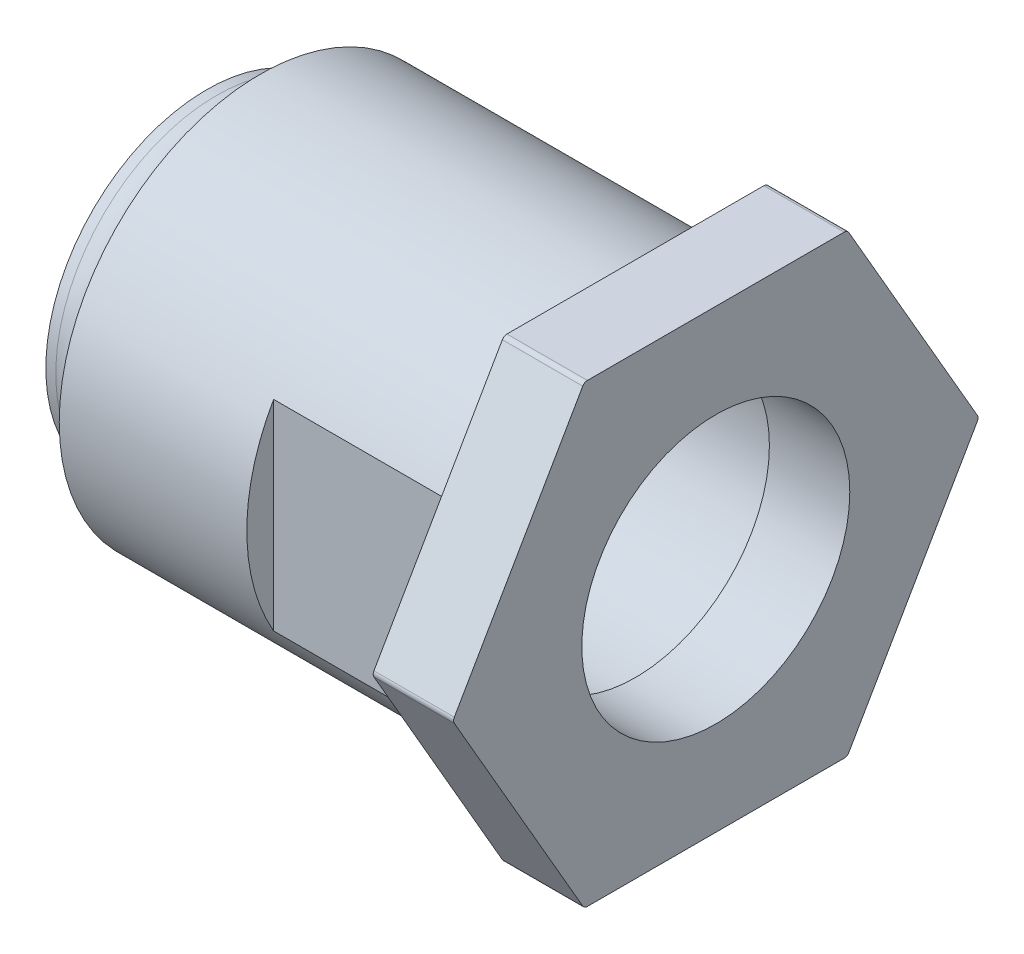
ISO-10303-21;
HEADER;
FILE_DESCRIPTION(('STEP AP214'),'2;1');
FILE_NAME('part.step','',(''),(''),'','','');
FILE_SCHEMA(('AUTOMOTIVE_DESIGN { 1 0 10303 214 1 1 1 1 }'));
ENDSEC;
DATA;
#1=APPLICATION_CONTEXT('core data for automotive mechanical design processes');
#2=APPLICATION_PROTOCOL_DEFINITION('international standard','automotive_design',2000,#1);
#3=PRODUCT_CONTEXT('',#1,'mechanical');
#4=PRODUCT('Part','Part','',(#3));
#5=PRODUCT_RELATED_PRODUCT_CATEGORY('part','',(#4));
#6=PRODUCT_DEFINITION_FORMATION('','',#4);
#7=PRODUCT_DEFINITION_CONTEXT('part definition',#1,'design');
#8=PRODUCT_DEFINITION('design','',#6,#7);
#9=PRODUCT_DEFINITION_SHAPE('','',#8);
#10=(LENGTH_UNIT() NAMED_UNIT(*) SI_UNIT(.MILLI.,.METRE.));
#11=(NAMED_UNIT(*) PLANE_ANGLE_UNIT() SI_UNIT($,.RADIAN.));
#12=(NAMED_UNIT(*) SI_UNIT($,.STERADIAN.) SOLID_ANGLE_UNIT());
#13=UNCERTAINTY_MEASURE_WITH_UNIT(LENGTH_MEASURE(1.E-05),#10,'distance_accuracy_value','');
#14=(GEOMETRIC_REPRESENTATION_CONTEXT(3) GLOBAL_UNCERTAINTY_ASSIGNED_CONTEXT((#13)) GLOBAL_UNIT_ASSIGNED_CONTEXT((#10,
#11,#12)) REPRESENTATION_CONTEXT('',''));
#15=CARTESIAN_POINT('',(0.,0.,0.));
#16=DIRECTION('',(0.,0.,1.));
#17=DIRECTION('',(1.,0.,0.));
#18=AXIS2_PLACEMENT_3D('',#15,#16,#17);
#19=CARTESIAN_POINT('',(0.,0.,0.));
#20=DIRECTION('',(1.,0.,0.));
#21=DIRECTION('',(0.,0.,-1.));
#22=AXIS2_PLACEMENT_3D('',#19,#20,#21);
#23=CYLINDRICAL_SURFACE('',#22,7.5);
#24=CARTESIAN_POINT('',(-14.,0.,0.));
#25=DIRECTION('',(1.,0.,0.));
#26=DIRECTION('',(0.,0.,-1.));
#27=AXIS2_PLACEMENT_3D('',#24,#25,#26);
#28=CIRCLE('',#27,7.5);
#29=CARTESIAN_POINT('',(-14.,0.,-7.5));
#30=VERTEX_POINT('',#29);
#31=EDGE_CURVE('E179',#30,#30,#28,.T.);
#32=ORIENTED_EDGE('',*,*,#31,.T.);
#33=EDGE_LOOP('',(#32));
#34=FACE_BOUND('',#33,.T.);
#35=CARTESIAN_POINT('',(0.,0.,0.));
#36=DIRECTION('',(1.,0.,0.));
#37=DIRECTION('',(0.,0.,-1.));
#38=AXIS2_PLACEMENT_3D('',#35,#36,#37);
#39=CIRCLE('',#38,7.5);
#40=CARTESIAN_POINT('',(0.,3.74165738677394,-6.5));
#41=VERTEX_POINT('',#40);
#42=CARTESIAN_POINT('',(0.,3.74165738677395,6.5));
#43=VERTEX_POINT('',#42);
#44=EDGE_CURVE('E164',#41,#43,#39,.T.);
#45=ORIENTED_EDGE('',*,*,#44,.F.);
#46=DIRECTION('',(1.,0.,0.));
#47=VECTOR('',#46,1.);
#48=CARTESIAN_POINT('',(0.,3.74165738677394,-6.5));
#49=LINE('',#48,#47);
#50=CARTESIAN_POINT('',(-7.,3.74165738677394,-6.5));
#51=VERTEX_POINT('',#50);
#52=EDGE_CURVE('E165',#41,#51,#49,.F.);
#53=ORIENTED_EDGE('',*,*,#52,.T.);
#54=CARTESIAN_POINT('',(-7.,0.,0.));
#55=DIRECTION('',(1.,0.,0.));
#56=DIRECTION('',(0.,0.,-1.));
#57=AXIS2_PLACEMENT_3D('',#54,#55,#56);
#58=CIRCLE('',#57,7.5);
#59=CARTESIAN_POINT('',(-7.,-3.74165738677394,-6.5));
#60=VERTEX_POINT('',#59);
#61=EDGE_CURVE('E189',#51,#60,#58,.F.);
#62=ORIENTED_EDGE('',*,*,#61,.T.);
#63=DIRECTION('',(1.,0.,0.));
#64=VECTOR('',#63,1.);
#65=CARTESIAN_POINT('',(0.,-3.74165738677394,-6.5));
#66=LINE('',#65,#64);
#67=CARTESIAN_POINT('',(0.,-3.74165738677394,-6.5));
#68=VERTEX_POINT('',#67);
#69=EDGE_CURVE('E160',#60,#68,#66,.T.);
#70=ORIENTED_EDGE('',*,*,#69,.T.);
#71=CARTESIAN_POINT('',(0.,-3.74165738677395,6.5));
#72=VERTEX_POINT('',#71);
#73=EDGE_CURVE('E154',#72,#68,#39,.T.);
#74=ORIENTED_EDGE('',*,*,#73,.F.);
#75=DIRECTION('',(1.,0.,0.));
#76=VECTOR('',#75,1.);
#77=CARTESIAN_POINT('',(0.,-3.74165738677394,6.5));
#78=LINE('',#77,#76);
#79=CARTESIAN_POINT('',(-7.,-3.74165738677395,6.5));
#80=VERTEX_POINT('',#79);
#81=EDGE_CURVE('E158',#72,#80,#78,.F.);
#82=ORIENTED_EDGE('',*,*,#81,.T.);
#83=CARTESIAN_POINT('',(-7.,3.74165738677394,6.5));
#84=VERTEX_POINT('',#83);
#85=EDGE_CURVE('E181',#80,#84,#58,.F.);
#86=ORIENTED_EDGE('',*,*,#85,.T.);
#87=DIRECTION('',(1.,0.,0.));
#88=VECTOR('',#87,1.);
#89=CARTESIAN_POINT('',(0.,3.74165738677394,6.5));
#90=LINE('',#89,#88);
#91=EDGE_CURVE('E174',#84,#43,#90,.T.);
#92=ORIENTED_EDGE('',*,*,#91,.T.);
#93=EDGE_LOOP('',(#45,#53,#62,#70,#74,#82,#86,#92));
#94=FACE_BOUND('',#93,.T.);
#95=ADVANCED_FACE('F38',(#34,#94),#23,.T.);
#96=CARTESIAN_POINT('',(-15.5051460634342,0.,0.));
#97=DIRECTION('',(1.,0.,0.));
#98=DIRECTION('',(0.,0.,-1.));
#99=AXIS2_PLACEMENT_3D('',#96,#97,#98);
#100=TOROIDAL_SURFACE('',#99,7.5,1.50514606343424);
#101=CARTESIAN_POINT('',(-15.6295030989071,0.,0.));
#102=DIRECTION('',(1.,0.,0.));
#103=DIRECTION('',(0.,0.,-1.));
#104=AXIS2_PLACEMENT_3D('',#101,#102,#103);
#105=CIRCLE('',#104,6.);
#106=CARTESIAN_POINT('',(-15.6295030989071,0.,-6.));
#107=VERTEX_POINT('',#106);
#108=EDGE_CURVE('E184',#107,#107,#105,.T.);
#109=ORIENTED_EDGE('',*,*,#108,.T.);
#110=EDGE_LOOP('',(#109));
#111=FACE_BOUND('',#110,.T.);
#112=ORIENTED_EDGE('',*,*,#31,.F.);
#113=EDGE_LOOP('',(#112));
#114=FACE_BOUND('',#113,.T.);
#115=ADVANCED_FACE('F302',(#111,#114),#100,.F.);
#116=CARTESIAN_POINT('',(0.,0.,0.));
#117=DIRECTION('',(1.,0.,0.));
#118=DIRECTION('',(0.,0.,-1.));
#119=AXIS2_PLACEMENT_3D('',#116,#117,#118);
#120=CYLINDRICAL_SURFACE('',#119,6.);
#121=CARTESIAN_POINT('',(-16.,0.,0.));
#122=DIRECTION('',(1.,0.,0.));
#123=DIRECTION('',(0.,0.,-1.));
#124=AXIS2_PLACEMENT_3D('',#121,#122,#123);
#125=CIRCLE('',#124,6.);
#126=CARTESIAN_POINT('',(-16.,0.,-6.));
#127=VERTEX_POINT('',#126);
#128=EDGE_CURVE('E297',#127,#127,#125,.T.);
#129=ORIENTED_EDGE('',*,*,#128,.T.);
#130=EDGE_LOOP('',(#129));
#131=FACE_BOUND('',#130,.T.);
#132=ORIENTED_EDGE('',*,*,#108,.F.);
#133=EDGE_LOOP('',(#132));
#134=FACE_BOUND('',#133,.T.);
#135=ADVANCED_FACE('F305',(#131,#134),#120,.T.);
#136=CARTESIAN_POINT('',(-16.,5.5,0.));
#137=DIRECTION('',(-1.,0.,0.));
#138=DIRECTION('',(0.,0.,1.));
#139=AXIS2_PLACEMENT_3D('',#136,#137,#138);
#140=PLANE('',#139);
#141=CARTESIAN_POINT('',(-16.,0.,0.));
#142=DIRECTION('',(1.,0.,0.));
#143=DIRECTION('',(0.,0.,-1.));
#144=AXIS2_PLACEMENT_3D('',#141,#142,#143);
#145=CIRCLE('',#144,5.5);
#146=CARTESIAN_POINT('',(-16.,0.,-5.5));
#147=VERTEX_POINT('',#146);
#148=EDGE_CURVE('E291',#147,#147,#145,.T.);
#149=ORIENTED_EDGE('',*,*,#148,.T.);
#150=EDGE_LOOP('',(#149));
#151=FACE_BOUND('',#150,.T.);
#152=ORIENTED_EDGE('',*,*,#128,.F.);
#153=EDGE_LOOP('',(#152));
#154=FACE_BOUND('',#153,.T.);
#155=ADVANCED_FACE('F307',(#151,#154),#140,.T.);
#156=CARTESIAN_POINT('',(0.,0.,0.));
#157=DIRECTION('',(1.,0.,0.));
#158=DIRECTION('',(0.,0.,-1.));
#159=AXIS2_PLACEMENT_3D('',#156,#157,#158);
#160=CYLINDRICAL_SURFACE('',#159,5.5);
#161=CARTESIAN_POINT('',(0.,0.,0.));
#162=DIRECTION('',(1.,0.,0.));
#163=DIRECTION('',(0.,0.,-1.));
#164=AXIS2_PLACEMENT_3D('',#161,#162,#163);
#165=CIRCLE('',#164,5.5);
#166=CARTESIAN_POINT('',(0.,0.,-5.5));
#167=VERTEX_POINT('',#166);
#168=EDGE_CURVE('E285',#167,#167,#165,.T.);
#169=ORIENTED_EDGE('',*,*,#168,.T.);
#170=EDGE_LOOP('',(#169));
#171=FACE_BOUND('',#170,.T.);
#172=ORIENTED_EDGE('',*,*,#148,.F.);
#173=EDGE_LOOP('',(#172));
#174=FACE_BOUND('',#173,.T.);
#175=ADVANCED_FACE('F314',(#171,#174),#160,.F.);
#176=CARTESIAN_POINT('',(-7.,8.5,6.5));
#177=DIRECTION('',(0.,0.,1.));
#178=DIRECTION('',(0.,-1.,0.));
#179=AXIS2_PLACEMENT_3D('',#176,#177,#178);
#180=PLANE('',#179);
#181=DIRECTION('',(0.,-1.,0.));
#182=VECTOR('',#181,1.);
#183=CARTESIAN_POINT('',(0.,7.5,6.5));
#184=LINE('',#183,#182);
#185=EDGE_CURVE('E170',#43,#72,#184,.T.);
#186=ORIENTED_EDGE('',*,*,#185,.F.);
#187=ORIENTED_EDGE('',*,*,#91,.F.);
#188=DIRECTION('',(0.,-1.,0.));
#189=VECTOR('',#188,1.);
#190=CARTESIAN_POINT('',(-7.,8.5,6.5));
#191=LINE('',#190,#189);
#192=EDGE_CURVE('E173',#84,#80,#191,.T.);
#193=ORIENTED_EDGE('',*,*,#192,.T.);
#194=ORIENTED_EDGE('',*,*,#81,.F.);
#195=EDGE_LOOP('',(#186,#187,#193,#194));
#196=FACE_BOUND('',#195,.T.);
#197=ADVANCED_FACE('F169',(#196),#180,.T.);
#198=CARTESIAN_POINT('',(-7.,0.,0.));
#199=DIRECTION('',(1.,0.,0.));
#200=DIRECTION('',(0.,0.,-1.));
#201=AXIS2_PLACEMENT_3D('',#198,#199,#200);
#202=PLANE('',#201);
#203=ORIENTED_EDGE('',*,*,#192,.F.);
#204=ORIENTED_EDGE('',*,*,#85,.F.);
#205=EDGE_LOOP('',(#203,#204));
#206=FACE_BOUND('',#205,.T.);
#207=ADVANCED_FACE('F410',(#206),#202,.T.);
#208=DIRECTION('',(0.,1.,0.));
#209=VECTOR('',#208,1.);
#210=CARTESIAN_POINT('',(-7.,8.5,-6.5));
#211=LINE('',#210,#209);
#212=EDGE_CURVE('E282',#60,#51,#211,.T.);
#213=ORIENTED_EDGE('',*,*,#212,.F.);
#214=ORIENTED_EDGE('',*,*,#61,.F.);
#215=EDGE_LOOP('',(#213,#214));
#216=FACE_BOUND('',#215,.T.);
#217=ADVANCED_FACE('F413',(#216),#202,.T.);
#218=CARTESIAN_POINT('',(-7.,8.5,-6.5));
#219=DIRECTION('',(0.,0.,-1.));
#220=DIRECTION('',(0.,1.,0.));
#221=AXIS2_PLACEMENT_3D('',#218,#219,#220);
#222=PLANE('',#221);
#223=DIRECTION('',(0.,1.,0.));
#224=VECTOR('',#223,1.);
#225=CARTESIAN_POINT('',(0.,7.5,-6.5));
#226=LINE('',#225,#224);
#227=EDGE_CURVE('E178',#68,#41,#226,.T.);
#228=ORIENTED_EDGE('',*,*,#227,.F.);
#229=ORIENTED_EDGE('',*,*,#69,.F.);
#230=ORIENTED_EDGE('',*,*,#212,.T.);
#231=ORIENTED_EDGE('',*,*,#52,.F.);
#232=EDGE_LOOP('',(#228,#229,#230,#231));
#233=FACE_BOUND('',#232,.T.);
#234=ADVANCED_FACE('F393',(#233),#222,.T.);
#235=CARTESIAN_POINT('',(0.,0.,0.));
#236=DIRECTION('',(1.,0.,0.));
#237=DIRECTION('',(0.,0.,-1.));
#238=AXIS2_PLACEMENT_3D('',#235,#236,#237);
#239=PLANE('',#238);
#240=DIRECTION('',(0.,-0.866025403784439,-0.5));
#241=VECTOR('',#240,1.);
#242=CARTESIAN_POINT('',(0.,0.,9.81495457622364));
#243=LINE('',#242,#241);
#244=CARTESIAN_POINT('',(0.,-0.100000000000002,9.75721954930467));
#245=VERTEX_POINT('',#244);
#246=CARTESIAN_POINT('',(0.,-8.4,4.96521231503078));
#247=VERTEX_POINT('',#246);
#248=EDGE_CURVE('E270',#245,#247,#243,.T.);
#249=ORIENTED_EDGE('',*,*,#248,.F.);
#250=CARTESIAN_POINT('',(0.,0.,9.58401446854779));
#251=DIRECTION('',(1.,0.,0.));
#252=DIRECTION('',(0.,0.,-1.));
#253=AXIS2_PLACEMENT_3D('',#250,#251,#252);
#254=CIRCLE('',#253,0.2);
#255=CARTESIAN_POINT('',(0.,0.0999999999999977,9.75721954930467));
#256=VERTEX_POINT('',#255);
#257=EDGE_CURVE('E205',#245,#256,#254,.F.);
#258=ORIENTED_EDGE('',*,*,#257,.T.);
#259=DIRECTION('',(0.,-0.866025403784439,0.5));
#260=VECTOR('',#259,1.);
#261=CARTESIAN_POINT('',(0.,8.5,4.90747728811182));
#262=LINE('',#261,#260);
#263=CARTESIAN_POINT('',(0.,8.4,4.96521231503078));
#264=VERTEX_POINT('',#263);
#265=EDGE_CURVE('E267',#264,#256,#262,.T.);
#266=ORIENTED_EDGE('',*,*,#265,.F.);
#267=CARTESIAN_POINT('',(0.,8.3,4.79200723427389));
#268=DIRECTION('',(1.,0.,0.));
#269=DIRECTION('',(0.,0.,-1.));
#270=AXIS2_PLACEMENT_3D('',#267,#268,#269);
#271=CIRCLE('',#270,0.2);
#272=CARTESIAN_POINT('',(0.,8.5,4.79200723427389));
#273=VERTEX_POINT('',#272);
#274=EDGE_CURVE('E199',#264,#273,#271,.F.);
#275=ORIENTED_EDGE('',*,*,#274,.T.);
#276=DIRECTION('',(0.,0.,1.));
#277=VECTOR('',#276,1.);
#278=CARTESIAN_POINT('',(0.,8.5,-4.90747728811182));
#279=LINE('',#278,#277);
#280=CARTESIAN_POINT('',(0.,8.5,-4.79200723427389));
#281=VERTEX_POINT('',#280);
#282=EDGE_CURVE('E262',#281,#273,#279,.T.);
#283=ORIENTED_EDGE('',*,*,#282,.F.);
#284=CARTESIAN_POINT('',(0.,8.3,-4.79200723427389));
#285=DIRECTION('',(1.,0.,0.));
#286=DIRECTION('',(0.,0.,-1.));
#287=AXIS2_PLACEMENT_3D('',#284,#285,#286);
#288=CIRCLE('',#287,0.2);
#289=CARTESIAN_POINT('',(0.,8.40000000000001,-4.96521231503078));
#290=VERTEX_POINT('',#289);
#291=EDGE_CURVE('E195',#281,#290,#288,.F.);
#292=ORIENTED_EDGE('',*,*,#291,.T.);
#293=DIRECTION('',(0.,0.866025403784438,0.500000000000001));
#294=VECTOR('',#293,1.);
#295=CARTESIAN_POINT('',(0.,0.,-9.81495457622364));
#296=LINE('',#295,#294);
#297=CARTESIAN_POINT('',(0.,0.100000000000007,-9.75721954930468));
#298=VERTEX_POINT('',#297);
#299=EDGE_CURVE('E245',#298,#290,#296,.T.);
#300=ORIENTED_EDGE('',*,*,#299,.F.);
#301=CARTESIAN_POINT('',(0.,0.,-9.58401446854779));
#302=DIRECTION('',(1.,0.,0.));
#303=DIRECTION('',(0.,0.,-1.));
#304=AXIS2_PLACEMENT_3D('',#301,#302,#303);
#305=CIRCLE('',#304,0.2);
#306=CARTESIAN_POINT('',(0.,-0.0999999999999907,-9.75721954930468));
#307=VERTEX_POINT('',#306);
#308=EDGE_CURVE('E197',#298,#307,#305,.F.);
#309=ORIENTED_EDGE('',*,*,#308,.T.);
#310=DIRECTION('',(0.,0.866025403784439,-0.5));
#311=VECTOR('',#310,1.);
#312=CARTESIAN_POINT('',(0.,-8.5,-4.90747728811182));
#313=LINE('',#312,#311);
#314=CARTESIAN_POINT('',(0.,-8.4,-4.96521231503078));
#315=VERTEX_POINT('',#314);
#316=EDGE_CURVE('E255',#315,#307,#313,.T.);
#317=ORIENTED_EDGE('',*,*,#316,.F.);
#318=CARTESIAN_POINT('',(0.,-8.3,-4.7920072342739));
#319=DIRECTION('',(1.,0.,0.));
#320=DIRECTION('',(0.,0.,-1.));
#321=AXIS2_PLACEMENT_3D('',#318,#319,#320);
#322=CIRCLE('',#321,0.2);
#323=CARTESIAN_POINT('',(0.,-8.5,-4.7920072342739));
#324=VERTEX_POINT('',#323);
#325=EDGE_CURVE('E201',#315,#324,#322,.F.);
#326=ORIENTED_EDGE('',*,*,#325,.T.);
#327=DIRECTION('',(0.,0.,-1.));
#328=VECTOR('',#327,1.);
#329=CARTESIAN_POINT('',(0.,-8.5,4.90747728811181));
#330=LINE('',#329,#328);
#331=CARTESIAN_POINT('',(0.,-8.5,4.79200723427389));
#332=VERTEX_POINT('',#331);
#333=EDGE_CURVE('E278',#332,#324,#330,.T.);
#334=ORIENTED_EDGE('',*,*,#333,.F.);
#335=CARTESIAN_POINT('',(0.,-8.3,4.79200723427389));
#336=DIRECTION('',(1.,0.,0.));
#337=DIRECTION('',(0.,0.,-1.));
#338=AXIS2_PLACEMENT_3D('',#335,#336,#337);
#339=CIRCLE('',#338,0.2);
#340=EDGE_CURVE('E203',#332,#247,#339,.F.);
#341=ORIENTED_EDGE('',*,*,#340,.T.);
#342=EDGE_LOOP('',(#249,#258,#266,#275,#283,#292,#300,#309,#317,#326,#334,#341));
#343=FACE_BOUND('',#342,.T.);
#344=ORIENTED_EDGE('',*,*,#185,.T.);
#345=ORIENTED_EDGE('',*,*,#73,.T.);
#346=ORIENTED_EDGE('',*,*,#227,.T.);
#347=ORIENTED_EDGE('',*,*,#44,.T.);
#348=EDGE_LOOP('',(#344,#345,#346,#347));
#349=FACE_BOUND('',#348,.T.);
#350=ADVANCED_FACE('F177',(#343,#349),#239,.F.);
#351=CARTESIAN_POINT('',(3.,0.,0.));
#352=DIRECTION('',(1.,0.,0.));
#353=DIRECTION('',(0.,0.,-1.));
#354=AXIS2_PLACEMENT_3D('',#351,#352,#353);
#355=PLANE('',#354);
#356=DIRECTION('',(0.,-0.866025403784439,0.5));
#357=VECTOR('',#356,1.);
#358=CARTESIAN_POINT('',(3.,8.5,4.90747728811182));
#359=LINE('',#358,#357);
#360=CARTESIAN_POINT('',(3.,8.4,4.96521231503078));
#361=VERTEX_POINT('',#360);
#362=CARTESIAN_POINT('',(3.,0.0999999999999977,9.75721954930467));
#363=VERTEX_POINT('',#362);
#364=EDGE_CURVE('E370',#361,#363,#359,.T.);
#365=ORIENTED_EDGE('',*,*,#364,.T.);
#366=CARTESIAN_POINT('',(3.,0.,9.58401446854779));
#367=DIRECTION('',(1.,0.,0.));
#368=DIRECTION('',(0.,0.,-1.));
#369=AXIS2_PLACEMENT_3D('',#366,#367,#368);
#370=CIRCLE('',#369,0.2);
#371=CARTESIAN_POINT('',(3.,-0.100000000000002,9.75721954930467));
#372=VERTEX_POINT('',#371);
#373=EDGE_CURVE('E221',#363,#372,#370,.T.);
#374=ORIENTED_EDGE('',*,*,#373,.T.);
#375=DIRECTION('',(0.,-0.866025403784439,-0.5));
#376=VECTOR('',#375,1.);
#377=CARTESIAN_POINT('',(3.,0.,9.81495457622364));
#378=LINE('',#377,#376);
#379=CARTESIAN_POINT('',(3.,-8.4,4.96521231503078));
#380=VERTEX_POINT('',#379);
#381=EDGE_CURVE('E363',#372,#380,#378,.T.);
#382=ORIENTED_EDGE('',*,*,#381,.T.);
#383=CARTESIAN_POINT('',(3.,-8.3,4.79200723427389));
#384=DIRECTION('',(1.,0.,0.));
#385=DIRECTION('',(0.,0.,-1.));
#386=AXIS2_PLACEMENT_3D('',#383,#384,#385);
#387=CIRCLE('',#386,0.2);
#388=CARTESIAN_POINT('',(3.,-8.5,4.79200723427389));
#389=VERTEX_POINT('',#388);
#390=EDGE_CURVE('E219',#380,#389,#387,.T.);
#391=ORIENTED_EDGE('',*,*,#390,.T.);
#392=DIRECTION('',(0.,0.,-1.));
#393=VECTOR('',#392,1.);
#394=CARTESIAN_POINT('',(3.,-8.5,4.90747728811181));
#395=LINE('',#394,#393);
#396=CARTESIAN_POINT('',(3.,-8.5,-4.7920072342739));
#397=VERTEX_POINT('',#396);
#398=EDGE_CURVE('E355',#389,#397,#395,.T.);
#399=ORIENTED_EDGE('',*,*,#398,.T.);
#400=CARTESIAN_POINT('',(3.,-8.3,-4.7920072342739));
#401=DIRECTION('',(1.,0.,0.));
#402=DIRECTION('',(0.,0.,-1.));
#403=AXIS2_PLACEMENT_3D('',#400,#401,#402);
#404=CIRCLE('',#403,0.2);
#405=CARTESIAN_POINT('',(3.,-8.4,-4.96521231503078));
#406=VERTEX_POINT('',#405);
#407=EDGE_CURVE('E60',#397,#406,#404,.T.);
#408=ORIENTED_EDGE('',*,*,#407,.T.);
#409=DIRECTION('',(0.,0.866025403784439,-0.5));
#410=VECTOR('',#409,1.);
#411=CARTESIAN_POINT('',(3.,-8.5,-4.90747728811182));
#412=LINE('',#411,#410);
#413=CARTESIAN_POINT('',(3.,-0.0999999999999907,-9.75721954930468));
#414=VERTEX_POINT('',#413);
#415=EDGE_CURVE('E294',#406,#414,#412,.T.);
#416=ORIENTED_EDGE('',*,*,#415,.T.);
#417=CARTESIAN_POINT('',(3.,0.,-9.58401446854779));
#418=DIRECTION('',(1.,0.,0.));
#419=DIRECTION('',(0.,0.,-1.));
#420=AXIS2_PLACEMENT_3D('',#417,#418,#419);
#421=CIRCLE('',#420,0.2);
#422=CARTESIAN_POINT('',(3.,0.100000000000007,-9.75721954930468));
#423=VERTEX_POINT('',#422);
#424=EDGE_CURVE('E214',#414,#423,#421,.T.);
#425=ORIENTED_EDGE('',*,*,#424,.T.);
#426=DIRECTION('',(0.,0.866025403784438,0.500000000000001));
#427=VECTOR('',#426,1.);
#428=CARTESIAN_POINT('',(3.,0.,-9.81495457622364));
#429=LINE('',#428,#427);
#430=CARTESIAN_POINT('',(3.,8.40000000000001,-4.96521231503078));
#431=VERTEX_POINT('',#430);
#432=EDGE_CURVE('E242',#423,#431,#429,.T.);
#433=ORIENTED_EDGE('',*,*,#432,.T.);
#434=CARTESIAN_POINT('',(3.,8.3,-4.79200723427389));
#435=DIRECTION('',(1.,0.,0.));
#436=DIRECTION('',(0.,0.,-1.));
#437=AXIS2_PLACEMENT_3D('',#434,#435,#436);
#438=CIRCLE('',#437,0.2);
#439=CARTESIAN_POINT('',(3.,8.5,-4.79200723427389));
#440=VERTEX_POINT('',#439);
#441=EDGE_CURVE('E212',#431,#440,#438,.T.);
#442=ORIENTED_EDGE('',*,*,#441,.T.);
#443=DIRECTION('',(0.,0.,1.));
#444=VECTOR('',#443,1.);
#445=CARTESIAN_POINT('',(3.,8.5,-4.90747728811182));
#446=LINE('',#445,#444);
#447=CARTESIAN_POINT('',(3.,8.5,4.79200723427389));
#448=VERTEX_POINT('',#447);
#449=EDGE_CURVE('E254',#440,#448,#446,.T.);
#450=ORIENTED_EDGE('',*,*,#449,.T.);
#451=CARTESIAN_POINT('',(3.,8.3,4.79200723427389));
#452=DIRECTION('',(1.,0.,0.));
#453=DIRECTION('',(0.,0.,-1.));
#454=AXIS2_PLACEMENT_3D('',#451,#452,#453);
#455=CIRCLE('',#454,0.2);
#456=EDGE_CURVE('E216',#448,#361,#455,.T.);
#457=ORIENTED_EDGE('',*,*,#456,.T.);
#458=EDGE_LOOP('',(#365,#374,#382,#391,#399,#408,#416,#425,#433,#442,#450,#457));
#459=FACE_BOUND('',#458,.T.);
#460=CARTESIAN_POINT('',(3.,0.,0.));
#461=DIRECTION('',(1.,0.,0.));
#462=DIRECTION('',(0.,0.,-1.));
#463=AXIS2_PLACEMENT_3D('',#460,#461,#462);
#464=CIRCLE('',#463,5.);
#465=CARTESIAN_POINT('',(3.,0.,-5.));
#466=VERTEX_POINT('',#465);
#467=EDGE_CURVE('E272',#466,#466,#464,.T.);
#468=ORIENTED_EDGE('',*,*,#467,.F.);
#469=EDGE_LOOP('',(#468));
#470=FACE_BOUND('',#469,.T.);
#471=ADVANCED_FACE('F249',(#459,#470),#355,.T.);
#472=ORIENTED_EDGE('',*,*,#168,.F.);
#473=EDGE_LOOP('',(#472));
#474=FACE_BOUND('',#473,.T.);
#475=CARTESIAN_POINT('',(0.,0.,0.));
#476=DIRECTION('',(1.,0.,0.));
#477=DIRECTION('',(0.,0.,-1.));
#478=AXIS2_PLACEMENT_3D('',#475,#476,#477);
#479=CIRCLE('',#478,5.);
#480=CARTESIAN_POINT('',(0.,0.,-5.));
#481=VERTEX_POINT('',#480);
#482=EDGE_CURVE('E377',#481,#481,#479,.T.);
#483=ORIENTED_EDGE('',*,*,#482,.T.);
#484=EDGE_LOOP('',(#483));
#485=FACE_BOUND('',#484,.T.);
#486=ADVANCED_FACE('F385',(#474,#485),#239,.F.);
#487=CARTESIAN_POINT('',(3.,0.,-9.81495457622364));
#488=DIRECTION('',(0.,-0.500000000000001,0.866025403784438));
#489=DIRECTION('',(0.,-0.866025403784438,-0.500000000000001));
#490=AXIS2_PLACEMENT_3D('',#487,#488,#489);
#491=PLANE('',#490);
#492=ORIENTED_EDGE('',*,*,#432,.F.);
#493=DIRECTION('',(-1.,0.,0.));
#494=VECTOR('',#493,1.);
#495=CARTESIAN_POINT('',(3.,0.100000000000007,-9.75721954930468));
#496=LINE('',#495,#494);
#497=EDGE_CURVE('E12',#423,#298,#496,.T.);
#498=ORIENTED_EDGE('',*,*,#497,.T.);
#499=ORIENTED_EDGE('',*,*,#299,.T.);
#500=DIRECTION('',(-1.,0.,0.));
#501=VECTOR('',#500,1.);
#502=CARTESIAN_POINT('',(3.,8.4,-4.96521231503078));
#503=LINE('',#502,#501);
#504=EDGE_CURVE('E46',#290,#431,#503,.F.);
#505=ORIENTED_EDGE('',*,*,#504,.T.);
#506=EDGE_LOOP('',(#492,#498,#499,#505));
#507=FACE_BOUND('',#506,.T.);
#508=ADVANCED_FACE('F241',(#507),#491,.F.);
#509=CARTESIAN_POINT('',(3.,8.5,-4.90747728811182));
#510=DIRECTION('',(0.,-1.,0.));
#511=DIRECTION('',(0.,0.,-1.));
#512=AXIS2_PLACEMENT_3D('',#509,#510,#511);
#513=PLANE('',#512);
#514=ORIENTED_EDGE('',*,*,#282,.T.);
#515=DIRECTION('',(-1.,0.,0.));
#516=VECTOR('',#515,1.);
#517=CARTESIAN_POINT('',(3.,8.5,4.79200723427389));
#518=LINE('',#517,#516);
#519=EDGE_CURVE('E235',#273,#448,#518,.F.);
#520=ORIENTED_EDGE('',*,*,#519,.T.);
#521=ORIENTED_EDGE('',*,*,#449,.F.);
#522=DIRECTION('',(-1.,0.,0.));
#523=VECTOR('',#522,1.);
#524=CARTESIAN_POINT('',(3.,8.5,-4.79200723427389));
#525=LINE('',#524,#523);
#526=EDGE_CURVE('E232',#440,#281,#525,.T.);
#527=ORIENTED_EDGE('',*,*,#526,.T.);
#528=EDGE_LOOP('',(#514,#520,#521,#527));
#529=FACE_BOUND('',#528,.T.);
#530=ADVANCED_FACE('F261',(#529),#513,.F.);
#531=CARTESIAN_POINT('',(3.,8.5,4.90747728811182));
#532=DIRECTION('',(0.,-0.5,-0.866025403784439));
#533=DIRECTION('',(0.,0.866025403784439,-0.5));
#534=AXIS2_PLACEMENT_3D('',#531,#532,#533);
#535=PLANE('',#534);
#536=ORIENTED_EDGE('',*,*,#265,.T.);
#537=DIRECTION('',(-1.,0.,0.));
#538=VECTOR('',#537,1.);
#539=CARTESIAN_POINT('',(3.,0.0999999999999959,9.75721954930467));
#540=LINE('',#539,#538);
#541=EDGE_CURVE('E210',#256,#363,#540,.F.);
#542=ORIENTED_EDGE('',*,*,#541,.T.);
#543=ORIENTED_EDGE('',*,*,#364,.F.);
#544=DIRECTION('',(-1.,0.,0.));
#545=VECTOR('',#544,1.);
#546=CARTESIAN_POINT('',(3.,8.4,4.96521231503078));
#547=LINE('',#546,#545);
#548=EDGE_CURVE('E207',#361,#264,#547,.T.);
#549=ORIENTED_EDGE('',*,*,#548,.T.);
#550=EDGE_LOOP('',(#536,#542,#543,#549));
#551=FACE_BOUND('',#550,.T.);
#552=ADVANCED_FACE('F367',(#551),#535,.F.);
#553=CARTESIAN_POINT('',(3.,0.,9.81495457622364));
#554=DIRECTION('',(0.,0.5,-0.866025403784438));
#555=DIRECTION('',(0.,0.866025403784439,0.5));
#556=AXIS2_PLACEMENT_3D('',#553,#554,#555);
#557=PLANE('',#556);
#558=ORIENTED_EDGE('',*,*,#381,.F.);
#559=DIRECTION('',(-1.,0.,0.));
#560=VECTOR('',#559,1.);
#561=CARTESIAN_POINT('',(3.,-0.100000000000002,9.75721954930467));
#562=LINE('',#561,#560);
#563=EDGE_CURVE('E192',#372,#245,#562,.T.);
#564=ORIENTED_EDGE('',*,*,#563,.T.);
#565=ORIENTED_EDGE('',*,*,#248,.T.);
#566=DIRECTION('',(-1.,0.,0.));
#567=VECTOR('',#566,1.);
#568=CARTESIAN_POINT('',(3.,-8.4,4.96521231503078));
#569=LINE('',#568,#567);
#570=EDGE_CURVE('E190',#247,#380,#569,.F.);
#571=ORIENTED_EDGE('',*,*,#570,.T.);
#572=EDGE_LOOP('',(#558,#564,#565,#571));
#573=FACE_BOUND('',#572,.T.);
#574=ADVANCED_FACE('F360',(#573),#557,.F.);
#575=CARTESIAN_POINT('',(3.,-8.5,4.90747728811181));
#576=DIRECTION('',(0.,1.,0.));
#577=DIRECTION('',(0.,0.,1.));
#578=AXIS2_PLACEMENT_3D('',#575,#576,#577);
#579=PLANE('',#578);
#580=ORIENTED_EDGE('',*,*,#398,.F.);
#581=DIRECTION('',(-1.,0.,0.));
#582=VECTOR('',#581,1.);
#583=CARTESIAN_POINT('',(3.,-8.5,4.79200723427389));
#584=LINE('',#583,#582);
#585=EDGE_CURVE('E225',#389,#332,#584,.T.);
#586=ORIENTED_EDGE('',*,*,#585,.T.);
#587=ORIENTED_EDGE('',*,*,#333,.T.);
#588=DIRECTION('',(-1.,0.,0.));
#589=VECTOR('',#588,1.);
#590=CARTESIAN_POINT('',(3.,-8.5,-4.7920072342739));
#591=LINE('',#590,#589);
#592=EDGE_CURVE('E223',#324,#397,#591,.F.);
#593=ORIENTED_EDGE('',*,*,#592,.T.);
#594=EDGE_LOOP('',(#580,#586,#587,#593));
#595=FACE_BOUND('',#594,.T.);
#596=ADVANCED_FACE('F353',(#595),#579,.F.);
#597=CARTESIAN_POINT('',(3.,-8.5,-4.90747728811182));
#598=DIRECTION('',(0.,0.5,0.866025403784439));
#599=DIRECTION('',(0.,-0.866025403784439,0.5));
#600=AXIS2_PLACEMENT_3D('',#597,#598,#599);
#601=PLANE('',#600);
#602=ORIENTED_EDGE('',*,*,#415,.F.);
#603=DIRECTION('',(-1.,0.,0.));
#604=VECTOR('',#603,1.);
#605=CARTESIAN_POINT('',(3.,-8.4,-4.96521231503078));
#606=LINE('',#605,#604);
#607=EDGE_CURVE('E229',#406,#315,#606,.T.);
#608=ORIENTED_EDGE('',*,*,#607,.T.);
#609=ORIENTED_EDGE('',*,*,#316,.T.);
#610=DIRECTION('',(-1.,0.,0.));
#611=VECTOR('',#610,1.);
#612=CARTESIAN_POINT('',(3.,-0.0999999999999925,-9.75721954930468));
#613=LINE('',#612,#611);
#614=EDGE_CURVE('E53',#307,#414,#613,.F.);
#615=ORIENTED_EDGE('',*,*,#614,.T.);
#616=EDGE_LOOP('',(#602,#608,#609,#615));
#617=FACE_BOUND('',#616,.T.);
#618=ADVANCED_FACE('F347',(#617),#601,.F.);
#619=CARTESIAN_POINT('',(3.,0.,0.));
#620=DIRECTION('',(-1.,0.,0.));
#621=DIRECTION('',(0.,0.,1.));
#622=AXIS2_PLACEMENT_3D('',#619,#620,#621);
#623=CYLINDRICAL_SURFACE('',#622,5.);
#624=ORIENTED_EDGE('',*,*,#467,.T.);
#625=EDGE_LOOP('',(#624));
#626=FACE_BOUND('',#625,.T.);
#627=ORIENTED_EDGE('',*,*,#482,.F.);
#628=EDGE_LOOP('',(#627));
#629=FACE_BOUND('',#628,.T.);
#630=ADVANCED_FACE('F328',(#626,#629),#623,.F.);
#631=CARTESIAN_POINT('',(3.,0.,9.58401446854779));
#632=DIRECTION('',(-1.,0.,0.));
#633=DIRECTION('',(0.,0.,1.));
#634=AXIS2_PLACEMENT_3D('',#631,#632,#633);
#635=CYLINDRICAL_SURFACE('',#634,0.2);
#636=ORIENTED_EDGE('',*,*,#373,.F.);
#637=ORIENTED_EDGE('',*,*,#541,.F.);
#638=ORIENTED_EDGE('',*,*,#257,.F.);
#639=ORIENTED_EDGE('',*,*,#563,.F.);
#640=EDGE_LOOP('',(#636,#637,#638,#639));
#641=FACE_BOUND('',#640,.T.);
#642=ADVANCED_FACE('F324',(#641),#635,.T.);
#643=CARTESIAN_POINT('',(3.,-8.3,4.79200723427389));
#644=DIRECTION('',(-1.,0.,0.));
#645=DIRECTION('',(0.,0.,1.));
#646=AXIS2_PLACEMENT_3D('',#643,#644,#645);
#647=CYLINDRICAL_SURFACE('',#646,0.2);
#648=ORIENTED_EDGE('',*,*,#390,.F.);
#649=ORIENTED_EDGE('',*,*,#570,.F.);
#650=ORIENTED_EDGE('',*,*,#340,.F.);
#651=ORIENTED_EDGE('',*,*,#585,.F.);
#652=EDGE_LOOP('',(#648,#649,#650,#651));
#653=FACE_BOUND('',#652,.T.);
#654=ADVANCED_FACE('F327',(#653),#647,.T.);
#655=CARTESIAN_POINT('',(3.,-8.3,-4.7920072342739));
#656=DIRECTION('',(-1.,0.,0.));
#657=DIRECTION('',(0.,0.,1.));
#658=AXIS2_PLACEMENT_3D('',#655,#656,#657);
#659=CYLINDRICAL_SURFACE('',#658,0.2);
#660=ORIENTED_EDGE('',*,*,#407,.F.);
#661=ORIENTED_EDGE('',*,*,#592,.F.);
#662=ORIENTED_EDGE('',*,*,#325,.F.);
#663=ORIENTED_EDGE('',*,*,#607,.F.);
#664=EDGE_LOOP('',(#660,#661,#662,#663));
#665=FACE_BOUND('',#664,.T.);
#666=ADVANCED_FACE('F332',(#665),#659,.T.);
#667=CARTESIAN_POINT('',(3.,8.3,4.79200723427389));
#668=DIRECTION('',(-1.,0.,0.));
#669=DIRECTION('',(0.,0.,1.));
#670=AXIS2_PLACEMENT_3D('',#667,#668,#669);
#671=CYLINDRICAL_SURFACE('',#670,0.2);
#672=ORIENTED_EDGE('',*,*,#456,.F.);
#673=ORIENTED_EDGE('',*,*,#519,.F.);
#674=ORIENTED_EDGE('',*,*,#274,.F.);
#675=ORIENTED_EDGE('',*,*,#548,.F.);
#676=EDGE_LOOP('',(#672,#673,#674,#675));
#677=FACE_BOUND('',#676,.T.);
#678=ADVANCED_FACE('F336',(#677),#671,.T.);
#679=CARTESIAN_POINT('',(3.,0.,-9.58401446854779));
#680=DIRECTION('',(-1.,0.,0.));
#681=DIRECTION('',(0.,0.,1.));
#682=AXIS2_PLACEMENT_3D('',#679,#680,#681);
#683=CYLINDRICAL_SURFACE('',#682,0.2);
#684=ORIENTED_EDGE('',*,*,#424,.F.);
#685=ORIENTED_EDGE('',*,*,#614,.F.);
#686=ORIENTED_EDGE('',*,*,#308,.F.);
#687=ORIENTED_EDGE('',*,*,#497,.F.);
#688=EDGE_LOOP('',(#684,#685,#686,#687));
#689=FACE_BOUND('',#688,.T.);
#690=ADVANCED_FACE('F339',(#689),#683,.T.);
#691=CARTESIAN_POINT('',(3.,8.3,-4.79200723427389));
#692=DIRECTION('',(-1.,0.,0.));
#693=DIRECTION('',(0.,0.,1.));
#694=AXIS2_PLACEMENT_3D('',#691,#692,#693);
#695=CYLINDRICAL_SURFACE('',#694,0.2);
#696=ORIENTED_EDGE('',*,*,#441,.F.);
#697=ORIENTED_EDGE('',*,*,#504,.F.);
#698=ORIENTED_EDGE('',*,*,#291,.F.);
#699=ORIENTED_EDGE('',*,*,#526,.F.);
#700=EDGE_LOOP('',(#696,#697,#698,#699));
#701=FACE_BOUND('',#700,.T.);
#702=ADVANCED_FACE('F40',(#701),#695,.T.);
#703=CLOSED_SHELL('',(#95,#115,#135,#155,#175,#197,#207,#217,#234,#350,#471,#486,#508,#530,#552,
#574,#596,#618,#630,#642,#654,#666,#678,#690,#702));
#704=MANIFOLD_SOLID_BREP('B2',#703);
#705=ADVANCED_BREP_SHAPE_REPRESENTATION('',(#18,#704),#14);
#706=SHAPE_DEFINITION_REPRESENTATION(#9,#705);
ENDSEC;
END-ISO-10303-21;
